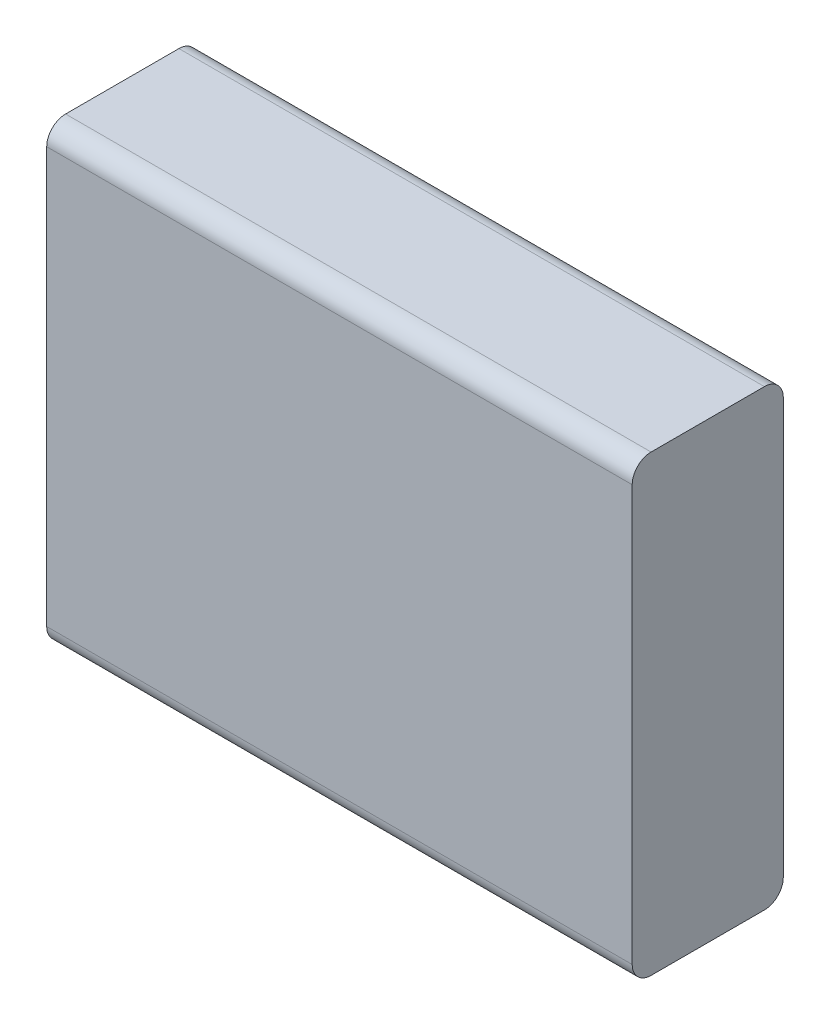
from build123d import *

# Parameters (mm, degrees)
ESQUISSE1_W             = 62
ESQUISSE1_H             = 48
BOSS_EXTRU_1_DEPTH      = 16
CONG_1_R                = 2
ESQUISSE3_W             = 4
ESQUISSE3_H             = 8
ENL_V_MAT_EXTRU_2_DEPTH = 2
ESQUISSE4_W             = 3.4
ESQUISSE4_H             = 3.4
BOSS_EXTRU_2_DEPTH      = 3.5


with BuildPart() as part:
    # Esquisse1 → Boss.-Extru.1 (new body)
    with BuildSketch(Plane.XY):
        with Locations((31, 24)):
            Rectangle(ESQUISSE1_W, ESQUISSE1_H)
    extrude(amount=BOSS_EXTRU_1_DEPTH)

    # Cong_1
    cong_1_edges = [part.edges().sort_by_distance(p)[0] for p in [
        (31, 48, 16),
        (31, 48, 0),
        (31, 0, 0),
        (31, 0, 16),
    ]]
    fillet(cong_1_edges, radius=CONG_1_R)

    # Esquisse3 → Enl_v. mat.-Extru.2 (cut)
    with BuildSketch(Plane(origin=(0, 0, 0), x_dir=(-1, 0, 0), z_dir=(0, 0, -1))):
        with Locations((-57, 35)):
            Rectangle(ESQUISSE3_W, ESQUISSE3_H)
    extrude(amount=-ENL_V_MAT_EXTRU_2_DEPTH, mode=Mode.SUBTRACT)

    # Esquisse4 → Boss.-Extru.2 (add)
    with BuildSketch(Plane(origin=(0, 0, 2), x_dir=(-1, 0, 0), z_dir=(0, 0, -1))):
        with Locations((-57, 37)):
            Rectangle(ESQUISSE4_W, ESQUISSE4_H)
    extrude(amount=BOSS_EXTRU_2_DEPTH)


solid = part.part
